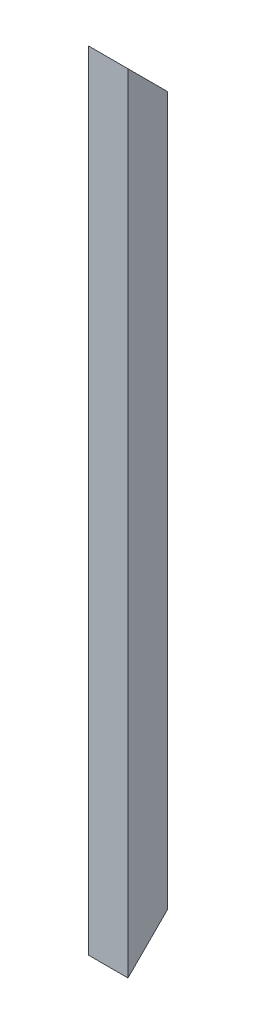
from build123d import *

# Parameters (mm, degrees)
SKETCH1_W           = 25.4
SKETCH1_H           = 25.4
SKETCH1_W_2         = 19.05
SKETCH1_H_2         = 19.05
BOSS_EXTRUDE1_DEPTH = 508
SKETCH2_OUTSIDE_W   = 129.254
SKETCH2_OUTSIDE_H   = 611.854
CUT_EXTRUDE1_DEPTH  = 509.79313085


with BuildPart() as part:
    # Sketch1 → Boss-Extrude1 (new body)
    with BuildSketch(Plane(origin=(0, 0, 0), x_dir=(1, 0, 0), z_dir=(0, 1, 0))):
        Rectangle(SKETCH1_W, SKETCH1_H)
        Rectangle(SKETCH1_W_2, SKETCH1_H_2, mode=Mode.SUBTRACT)
    extrude(amount=BOSS_EXTRUDE1_DEPTH)

    # Sketch2 outside → Cut-Extrude1 (cut, through all)
    with BuildSketch(Plane.ZY.offset(12.7)):
        with Locations((0, 254)):
            Rectangle(SKETCH2_OUTSIDE_W, SKETCH2_OUTSIDE_H)
        Polygon((12.7, 508), (-12.7, 482.6), (-12.7, 25.4), (12.7, 0), align=None, mode=Mode.SUBTRACT)
    extrude(amount=-CUT_EXTRUDE1_DEPTH, mode=Mode.SUBTRACT)


solid = part.part
